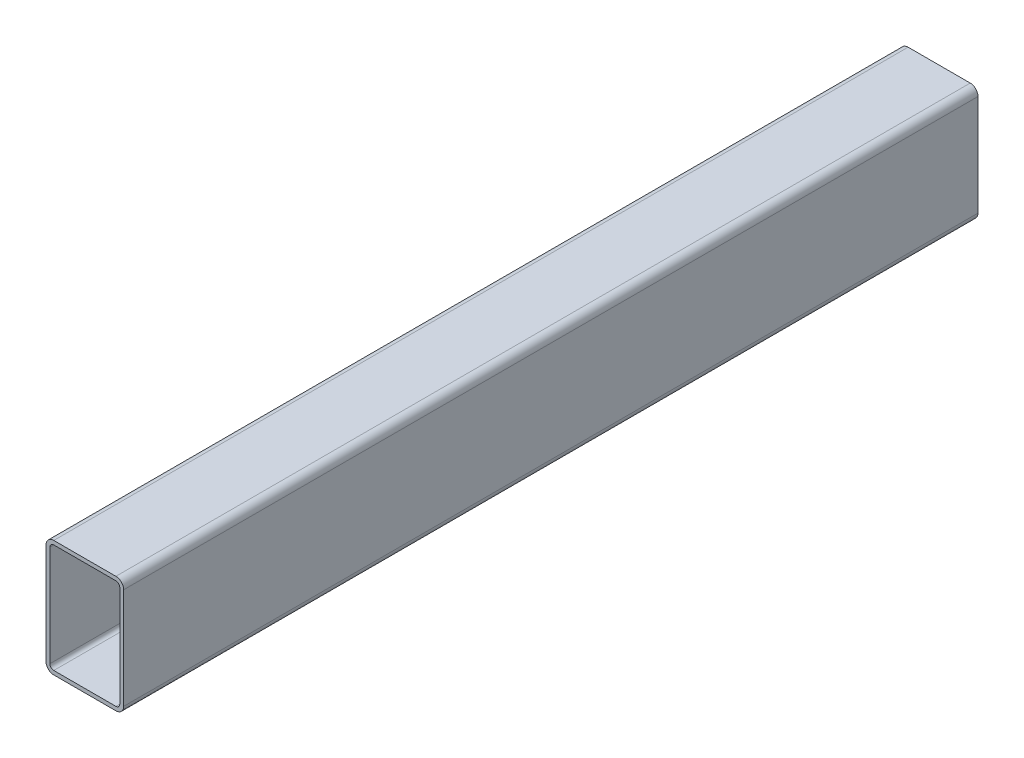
ISO-10303-21;
HEADER;
FILE_DESCRIPTION(('STEP AP214'),'2;1');
FILE_NAME('part.step','',(''),(''),'','','');
FILE_SCHEMA(('AUTOMOTIVE_DESIGN { 1 0 10303 214 1 1 1 1 }'));
ENDSEC;
DATA;
#1=APPLICATION_CONTEXT('core data for automotive mechanical design processes');
#2=APPLICATION_PROTOCOL_DEFINITION('international standard','automotive_design',2000,#1);
#3=PRODUCT_CONTEXT('',#1,'mechanical');
#4=PRODUCT('Part','Part','',(#3));
#5=PRODUCT_RELATED_PRODUCT_CATEGORY('part','',(#4));
#6=PRODUCT_DEFINITION_FORMATION('','',#4);
#7=PRODUCT_DEFINITION_CONTEXT('part definition',#1,'design');
#8=PRODUCT_DEFINITION('design','',#6,#7);
#9=PRODUCT_DEFINITION_SHAPE('','',#8);
#10=(LENGTH_UNIT() NAMED_UNIT(*) SI_UNIT(.MILLI.,.METRE.));
#11=(NAMED_UNIT(*) PLANE_ANGLE_UNIT() SI_UNIT($,.RADIAN.));
#12=(NAMED_UNIT(*) SI_UNIT($,.STERADIAN.) SOLID_ANGLE_UNIT());
#13=UNCERTAINTY_MEASURE_WITH_UNIT(LENGTH_MEASURE(1.E-05),#10,'distance_accuracy_value','');
#14=(GEOMETRIC_REPRESENTATION_CONTEXT(3) GLOBAL_UNCERTAINTY_ASSIGNED_CONTEXT((#13)) GLOBAL_UNIT_ASSIGNED_CONTEXT((#10,
#11,#12)) REPRESENTATION_CONTEXT('',''));
#15=CARTESIAN_POINT('',(0.,0.,0.));
#16=DIRECTION('',(0.,0.,1.));
#17=DIRECTION('',(1.,0.,0.));
#18=AXIS2_PLACEMENT_3D('',#15,#16,#17);
#19=CARTESIAN_POINT('',(-16.,26.0000000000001,220.));
#20=DIRECTION('',(0.,0.,1.));
#21=DIRECTION('',(1.,0.,0.));
#22=AXIS2_PLACEMENT_3D('',#19,#20,#21);
#23=PLANE('',#22);
#24=CARTESIAN_POINT('',(-16.,26.0000000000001,220.));
#25=DIRECTION('',(0.,0.,1.));
#26=DIRECTION('',(-1.,0.,0.));
#27=AXIS2_PLACEMENT_3D('',#24,#25,#26);
#28=CIRCLE('',#27,4.00000000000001);
#29=CARTESIAN_POINT('',(-16.,30.0000000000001,220.));
#30=VERTEX_POINT('',#29);
#31=CARTESIAN_POINT('',(-20.,26.0000000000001,220.));
#32=VERTEX_POINT('',#31);
#33=EDGE_CURVE('E221',#30,#32,#28,.T.);
#34=ORIENTED_EDGE('',*,*,#33,.T.);
#35=DIRECTION('',(0.,-1.,0.));
#36=VECTOR('',#35,1.);
#37=CARTESIAN_POINT('',(-20.,26.0000000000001,220.));
#38=LINE('',#37,#36);
#39=CARTESIAN_POINT('',(-20.,-25.9999999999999,220.));
#40=VERTEX_POINT('',#39);
#41=EDGE_CURVE('E224',#32,#40,#38,.T.);
#42=ORIENTED_EDGE('',*,*,#41,.T.);
#43=CARTESIAN_POINT('',(-16.,-25.9999999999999,220.));
#44=DIRECTION('',(0.,0.,1.));
#45=DIRECTION('',(1.,0.,0.));
#46=AXIS2_PLACEMENT_3D('',#43,#44,#45);
#47=CIRCLE('',#46,4.00000000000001);
#48=CARTESIAN_POINT('',(-16.,-29.9999999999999,220.));
#49=VERTEX_POINT('',#48);
#50=EDGE_CURVE('E226',#40,#49,#47,.T.);
#51=ORIENTED_EDGE('',*,*,#50,.T.);
#52=DIRECTION('',(1.,0.,0.));
#53=VECTOR('',#52,1.);
#54=CARTESIAN_POINT('',(16.,-29.9999999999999,220.));
#55=LINE('',#54,#53);
#56=CARTESIAN_POINT('',(16.,-29.9999999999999,220.));
#57=VERTEX_POINT('',#56);
#58=EDGE_CURVE('E228',#49,#57,#55,.T.);
#59=ORIENTED_EDGE('',*,*,#58,.T.);
#60=CARTESIAN_POINT('',(16.,-25.9999999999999,220.));
#61=DIRECTION('',(0.,0.,1.));
#62=DIRECTION('',(1.,0.,0.));
#63=AXIS2_PLACEMENT_3D('',#60,#61,#62);
#64=CIRCLE('',#63,4.00000000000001);
#65=CARTESIAN_POINT('',(20.,-25.9999999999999,220.));
#66=VERTEX_POINT('',#65);
#67=EDGE_CURVE('E230',#57,#66,#64,.T.);
#68=ORIENTED_EDGE('',*,*,#67,.T.);
#69=DIRECTION('',(0.,1.,0.));
#70=VECTOR('',#69,1.);
#71=CARTESIAN_POINT('',(20.,26.0000000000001,220.));
#72=LINE('',#71,#70);
#73=CARTESIAN_POINT('',(20.,26.0000000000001,220.));
#74=VERTEX_POINT('',#73);
#75=EDGE_CURVE('E232',#66,#74,#72,.T.);
#76=ORIENTED_EDGE('',*,*,#75,.T.);
#77=CARTESIAN_POINT('',(16.,26.0000000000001,220.));
#78=DIRECTION('',(0.,0.,1.));
#79=DIRECTION('',(1.,0.,0.));
#80=AXIS2_PLACEMENT_3D('',#77,#78,#79);
#81=CIRCLE('',#80,4.00000000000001);
#82=CARTESIAN_POINT('',(16.,30.0000000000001,220.));
#83=VERTEX_POINT('',#82);
#84=EDGE_CURVE('E234',#74,#83,#81,.T.);
#85=ORIENTED_EDGE('',*,*,#84,.T.);
#86=DIRECTION('',(-1.,0.,0.));
#87=VECTOR('',#86,1.);
#88=CARTESIAN_POINT('',(16.,30.0000000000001,220.));
#89=LINE('',#88,#87);
#90=EDGE_CURVE('E236',#83,#30,#89,.T.);
#91=ORIENTED_EDGE('',*,*,#90,.T.);
#92=EDGE_LOOP('',(#34,#42,#51,#59,#68,#76,#85,#91));
#93=FACE_BOUND('',#92,.T.);
#94=DIRECTION('',(0.,-1.,0.));
#95=VECTOR('',#94,1.);
#96=CARTESIAN_POINT('',(-18.,26.0000000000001,220.));
#97=LINE('',#96,#95);
#98=CARTESIAN_POINT('',(-18.,26.0000000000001,220.));
#99=VERTEX_POINT('',#98);
#100=CARTESIAN_POINT('',(-18.,-25.9999999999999,220.));
#101=VERTEX_POINT('',#100);
#102=EDGE_CURVE('E179',#99,#101,#97,.T.);
#103=ORIENTED_EDGE('',*,*,#102,.F.);
#104=CARTESIAN_POINT('',(-16.,26.0000000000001,220.));
#105=DIRECTION('',(0.,0.,-1.));
#106=DIRECTION('',(-1.,0.,0.));
#107=AXIS2_PLACEMENT_3D('',#104,#105,#106);
#108=CIRCLE('',#107,2.00000000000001);
#109=CARTESIAN_POINT('',(-16.,28.0000000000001,220.));
#110=VERTEX_POINT('',#109);
#111=EDGE_CURVE('E156',#110,#99,#108,.F.);
#112=ORIENTED_EDGE('',*,*,#111,.F.);
#113=DIRECTION('',(-1.,0.,0.));
#114=VECTOR('',#113,1.);
#115=CARTESIAN_POINT('',(-16.,28.0000000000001,220.));
#116=LINE('',#115,#114);
#117=CARTESIAN_POINT('',(16.,28.0000000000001,220.));
#118=VERTEX_POINT('',#117);
#119=EDGE_CURVE('E191',#118,#110,#116,.T.);
#120=ORIENTED_EDGE('',*,*,#119,.F.);
#121=CARTESIAN_POINT('',(16.,26.0000000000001,220.));
#122=DIRECTION('',(0.,0.,-1.));
#123=DIRECTION('',(-1.,0.,0.));
#124=AXIS2_PLACEMENT_3D('',#121,#122,#123);
#125=CIRCLE('',#124,2.00000000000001);
#126=CARTESIAN_POINT('',(18.,26.0000000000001,220.));
#127=VERTEX_POINT('',#126);
#128=EDGE_CURVE('E189',#127,#118,#125,.F.);
#129=ORIENTED_EDGE('',*,*,#128,.F.);
#130=DIRECTION('',(0.,1.,0.));
#131=VECTOR('',#130,1.);
#132=CARTESIAN_POINT('',(18.,26.0000000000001,220.));
#133=LINE('',#132,#131);
#134=CARTESIAN_POINT('',(18.,-25.9999999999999,220.));
#135=VERTEX_POINT('',#134);
#136=EDGE_CURVE('E187',#135,#127,#133,.T.);
#137=ORIENTED_EDGE('',*,*,#136,.F.);
#138=CARTESIAN_POINT('',(16.,-25.9999999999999,220.));
#139=DIRECTION('',(0.,0.,-1.));
#140=DIRECTION('',(-1.,0.,0.));
#141=AXIS2_PLACEMENT_3D('',#138,#139,#140);
#142=CIRCLE('',#141,2.00000000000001);
#143=CARTESIAN_POINT('',(16.,-27.9999999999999,220.));
#144=VERTEX_POINT('',#143);
#145=EDGE_CURVE('E185',#144,#135,#142,.F.);
#146=ORIENTED_EDGE('',*,*,#145,.F.);
#147=DIRECTION('',(1.,0.,0.));
#148=VECTOR('',#147,1.);
#149=CARTESIAN_POINT('',(-16.,-27.9999999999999,220.));
#150=LINE('',#149,#148);
#151=CARTESIAN_POINT('',(-16.,-27.9999999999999,220.));
#152=VERTEX_POINT('',#151);
#153=EDGE_CURVE('E183',#152,#144,#150,.T.);
#154=ORIENTED_EDGE('',*,*,#153,.F.);
#155=CARTESIAN_POINT('',(-16.,-25.9999999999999,220.));
#156=DIRECTION('',(0.,0.,-1.));
#157=DIRECTION('',(-1.,0.,0.));
#158=AXIS2_PLACEMENT_3D('',#155,#156,#157);
#159=CIRCLE('',#158,2.00000000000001);
#160=EDGE_CURVE('E181',#101,#152,#159,.F.);
#161=ORIENTED_EDGE('',*,*,#160,.F.);
#162=EDGE_LOOP('',(#103,#112,#120,#129,#137,#146,#154,#161));
#163=FACE_BOUND('',#162,.T.);
#164=ADVANCED_FACE('F28',(#93,#163),#23,.T.);
#165=CARTESIAN_POINT('',(-16.,25.9999999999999,-220.));
#166=DIRECTION('',(0.,0.,1.));
#167=DIRECTION('',(1.,0.,0.));
#168=AXIS2_PLACEMENT_3D('',#165,#166,#167);
#169=PLANE('',#168);
#170=CARTESIAN_POINT('',(-16.,25.9999999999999,-220.));
#171=DIRECTION('',(0.,0.,1.));
#172=DIRECTION('',(-1.,0.,0.));
#173=AXIS2_PLACEMENT_3D('',#170,#171,#172);
#174=CIRCLE('',#173,4.00000000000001);
#175=CARTESIAN_POINT('',(-16.,29.9999999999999,-220.));
#176=VERTEX_POINT('',#175);
#177=CARTESIAN_POINT('',(-20.,25.9999999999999,-220.));
#178=VERTEX_POINT('',#177);
#179=EDGE_CURVE('E157',#176,#178,#174,.T.);
#180=ORIENTED_EDGE('',*,*,#179,.F.);
#181=DIRECTION('',(-1.,0.,0.));
#182=VECTOR('',#181,1.);
#183=CARTESIAN_POINT('',(16.,29.9999999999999,-220.));
#184=LINE('',#183,#182);
#185=CARTESIAN_POINT('',(16.,29.9999999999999,-220.));
#186=VERTEX_POINT('',#185);
#187=EDGE_CURVE('E219',#186,#176,#184,.T.);
#188=ORIENTED_EDGE('',*,*,#187,.F.);
#189=CARTESIAN_POINT('',(16.,25.9999999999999,-220.));
#190=DIRECTION('',(0.,0.,1.));
#191=DIRECTION('',(1.,0.,0.));
#192=AXIS2_PLACEMENT_3D('',#189,#190,#191);
#193=CIRCLE('',#192,4.00000000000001);
#194=CARTESIAN_POINT('',(20.,25.9999999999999,-220.));
#195=VERTEX_POINT('',#194);
#196=EDGE_CURVE('E217',#195,#186,#193,.T.);
#197=ORIENTED_EDGE('',*,*,#196,.F.);
#198=DIRECTION('',(0.,1.,0.));
#199=VECTOR('',#198,1.);
#200=CARTESIAN_POINT('',(20.,25.9999999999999,-220.));
#201=LINE('',#200,#199);
#202=CARTESIAN_POINT('',(20.,-26.0000000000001,-220.));
#203=VERTEX_POINT('',#202);
#204=EDGE_CURVE('E215',#203,#195,#201,.T.);
#205=ORIENTED_EDGE('',*,*,#204,.F.);
#206=CARTESIAN_POINT('',(16.,-26.0000000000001,-220.));
#207=DIRECTION('',(0.,0.,1.));
#208=DIRECTION('',(1.,0.,0.));
#209=AXIS2_PLACEMENT_3D('',#206,#207,#208);
#210=CIRCLE('',#209,4.00000000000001);
#211=CARTESIAN_POINT('',(16.,-30.0000000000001,-220.));
#212=VERTEX_POINT('',#211);
#213=EDGE_CURVE('E213',#212,#203,#210,.T.);
#214=ORIENTED_EDGE('',*,*,#213,.F.);
#215=DIRECTION('',(1.,0.,0.));
#216=VECTOR('',#215,1.);
#217=CARTESIAN_POINT('',(16.,-30.0000000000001,-220.));
#218=LINE('',#217,#216);
#219=CARTESIAN_POINT('',(-16.,-30.0000000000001,-220.));
#220=VERTEX_POINT('',#219);
#221=EDGE_CURVE('E211',#220,#212,#218,.T.);
#222=ORIENTED_EDGE('',*,*,#221,.F.);
#223=CARTESIAN_POINT('',(-16.,-26.0000000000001,-220.));
#224=DIRECTION('',(0.,0.,1.));
#225=DIRECTION('',(1.,0.,0.));
#226=AXIS2_PLACEMENT_3D('',#223,#224,#225);
#227=CIRCLE('',#226,4.00000000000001);
#228=CARTESIAN_POINT('',(-20.,-26.0000000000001,-220.));
#229=VERTEX_POINT('',#228);
#230=EDGE_CURVE('E209',#229,#220,#227,.T.);
#231=ORIENTED_EDGE('',*,*,#230,.F.);
#232=DIRECTION('',(0.,-1.,0.));
#233=VECTOR('',#232,1.);
#234=CARTESIAN_POINT('',(-20.,25.9999999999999,-220.));
#235=LINE('',#234,#233);
#236=EDGE_CURVE('E207',#178,#229,#235,.T.);
#237=ORIENTED_EDGE('',*,*,#236,.F.);
#238=EDGE_LOOP('',(#180,#188,#197,#205,#214,#222,#231,#237));
#239=FACE_BOUND('',#238,.T.);
#240=CARTESIAN_POINT('',(-16.,25.9999999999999,-220.));
#241=DIRECTION('',(0.,0.,-1.));
#242=DIRECTION('',(-1.,0.,0.));
#243=AXIS2_PLACEMENT_3D('',#240,#241,#242);
#244=CIRCLE('',#243,2.00000000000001);
#245=CARTESIAN_POINT('',(-16.,27.9999999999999,-220.));
#246=VERTEX_POINT('',#245);
#247=CARTESIAN_POINT('',(-18.,25.9999999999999,-220.));
#248=VERTEX_POINT('',#247);
#249=EDGE_CURVE('E51',#246,#248,#244,.F.);
#250=ORIENTED_EDGE('',*,*,#249,.T.);
#251=DIRECTION('',(0.,-1.,0.));
#252=VECTOR('',#251,1.);
#253=CARTESIAN_POINT('',(-18.,25.9999999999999,-220.));
#254=LINE('',#253,#252);
#255=CARTESIAN_POINT('',(-18.,-26.0000000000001,-220.));
#256=VERTEX_POINT('',#255);
#257=EDGE_CURVE('E143',#248,#256,#254,.T.);
#258=ORIENTED_EDGE('',*,*,#257,.T.);
#259=CARTESIAN_POINT('',(-16.,-26.0000000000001,-220.));
#260=DIRECTION('',(0.,0.,-1.));
#261=DIRECTION('',(-1.,0.,0.));
#262=AXIS2_PLACEMENT_3D('',#259,#260,#261);
#263=CIRCLE('',#262,2.00000000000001);
#264=CARTESIAN_POINT('',(-16.,-28.0000000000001,-220.));
#265=VERTEX_POINT('',#264);
#266=EDGE_CURVE('E152',#256,#265,#263,.F.);
#267=ORIENTED_EDGE('',*,*,#266,.T.);
#268=DIRECTION('',(1.,0.,0.));
#269=VECTOR('',#268,1.);
#270=CARTESIAN_POINT('',(-16.,-28.0000000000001,-220.));
#271=LINE('',#270,#269);
#272=CARTESIAN_POINT('',(16.,-28.0000000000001,-220.));
#273=VERTEX_POINT('',#272);
#274=EDGE_CURVE('E166',#265,#273,#271,.T.);
#275=ORIENTED_EDGE('',*,*,#274,.T.);
#276=CARTESIAN_POINT('',(16.,-26.0000000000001,-220.));
#277=DIRECTION('',(0.,0.,-1.));
#278=DIRECTION('',(-1.,0.,0.));
#279=AXIS2_PLACEMENT_3D('',#276,#277,#278);
#280=CIRCLE('',#279,2.00000000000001);
#281=CARTESIAN_POINT('',(18.,-26.0000000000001,-220.));
#282=VERTEX_POINT('',#281);
#283=EDGE_CURVE('E169',#273,#282,#280,.F.);
#284=ORIENTED_EDGE('',*,*,#283,.T.);
#285=DIRECTION('',(0.,1.,0.));
#286=VECTOR('',#285,1.);
#287=CARTESIAN_POINT('',(18.,25.9999999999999,-220.));
#288=LINE('',#287,#286);
#289=CARTESIAN_POINT('',(18.,25.9999999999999,-220.));
#290=VERTEX_POINT('',#289);
#291=EDGE_CURVE('E172',#282,#290,#288,.T.);
#292=ORIENTED_EDGE('',*,*,#291,.T.);
#293=CARTESIAN_POINT('',(16.,25.9999999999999,-220.));
#294=DIRECTION('',(0.,0.,-1.));
#295=DIRECTION('',(-1.,0.,0.));
#296=AXIS2_PLACEMENT_3D('',#293,#294,#295);
#297=CIRCLE('',#296,2.00000000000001);
#298=CARTESIAN_POINT('',(16.,27.9999999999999,-220.));
#299=VERTEX_POINT('',#298);
#300=EDGE_CURVE('E175',#290,#299,#297,.F.);
#301=ORIENTED_EDGE('',*,*,#300,.T.);
#302=DIRECTION('',(-1.,0.,0.));
#303=VECTOR('',#302,1.);
#304=CARTESIAN_POINT('',(-16.,27.9999999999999,-220.));
#305=LINE('',#304,#303);
#306=EDGE_CURVE('E162',#299,#246,#305,.T.);
#307=ORIENTED_EDGE('',*,*,#306,.T.);
#308=EDGE_LOOP('',(#250,#258,#267,#275,#284,#292,#301,#307));
#309=FACE_BOUND('',#308,.T.);
#310=ADVANCED_FACE('F160',(#239,#309),#169,.F.);
#311=CARTESIAN_POINT('',(-16.,26.0000000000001,220.));
#312=DIRECTION('',(0.,0.,-1.));
#313=DIRECTION('',(-1.,0.,0.));
#314=AXIS2_PLACEMENT_3D('',#311,#312,#313);
#315=CYLINDRICAL_SURFACE('',#314,4.00000000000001);
#316=ORIENTED_EDGE('',*,*,#179,.T.);
#317=DIRECTION('',(0.,0.,-1.));
#318=VECTOR('',#317,1.);
#319=CARTESIAN_POINT('',(-20.,26.0000000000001,220.));
#320=LINE('',#319,#318);
#321=EDGE_CURVE('E11',#32,#178,#320,.T.);
#322=ORIENTED_EDGE('',*,*,#321,.F.);
#323=ORIENTED_EDGE('',*,*,#33,.F.);
#324=DIRECTION('',(0.,0.,-1.));
#325=VECTOR('',#324,1.);
#326=CARTESIAN_POINT('',(-16.,30.0000000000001,220.));
#327=LINE('',#326,#325);
#328=EDGE_CURVE('E238',#30,#176,#327,.T.);
#329=ORIENTED_EDGE('',*,*,#328,.T.);
#330=EDGE_LOOP('',(#316,#322,#323,#329));
#331=FACE_BOUND('',#330,.T.);
#332=ADVANCED_FACE('F30',(#331),#315,.T.);
#333=CARTESIAN_POINT('',(-20.,26.0000000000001,220.));
#334=DIRECTION('',(1.,0.,0.));
#335=DIRECTION('',(0.,0.,-1.));
#336=AXIS2_PLACEMENT_3D('',#333,#334,#335);
#337=PLANE('',#336);
#338=ORIENTED_EDGE('',*,*,#236,.T.);
#339=DIRECTION('',(0.,0.,-1.));
#340=VECTOR('',#339,1.);
#341=CARTESIAN_POINT('',(-20.,-25.9999999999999,220.));
#342=LINE('',#341,#340);
#343=EDGE_CURVE('E36',#40,#229,#342,.T.);
#344=ORIENTED_EDGE('',*,*,#343,.F.);
#345=ORIENTED_EDGE('',*,*,#41,.F.);
#346=ORIENTED_EDGE('',*,*,#321,.T.);
#347=EDGE_LOOP('',(#338,#344,#345,#346));
#348=FACE_BOUND('',#347,.T.);
#349=ADVANCED_FACE('F282',(#348),#337,.F.);
#350=CARTESIAN_POINT('',(-16.,-25.9999999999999,220.));
#351=DIRECTION('',(0.,0.,-1.));
#352=DIRECTION('',(-1.,0.,0.));
#353=AXIS2_PLACEMENT_3D('',#350,#351,#352);
#354=CYLINDRICAL_SURFACE('',#353,4.00000000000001);
#355=ORIENTED_EDGE('',*,*,#230,.T.);
#356=DIRECTION('',(0.,0.,-1.));
#357=VECTOR('',#356,1.);
#358=CARTESIAN_POINT('',(-16.,-29.9999999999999,220.));
#359=LINE('',#358,#357);
#360=EDGE_CURVE('E253',#49,#220,#359,.T.);
#361=ORIENTED_EDGE('',*,*,#360,.F.);
#362=ORIENTED_EDGE('',*,*,#50,.F.);
#363=ORIENTED_EDGE('',*,*,#343,.T.);
#364=EDGE_LOOP('',(#355,#361,#362,#363));
#365=FACE_BOUND('',#364,.T.);
#366=ADVANCED_FACE('F260',(#365),#354,.T.);
#367=CARTESIAN_POINT('',(16.,-29.9999999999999,220.));
#368=DIRECTION('',(0.,1.,0.));
#369=DIRECTION('',(-1.,0.,0.));
#370=AXIS2_PLACEMENT_3D('',#367,#368,#369);
#371=PLANE('',#370);
#372=ORIENTED_EDGE('',*,*,#221,.T.);
#373=DIRECTION('',(0.,0.,-1.));
#374=VECTOR('',#373,1.);
#375=CARTESIAN_POINT('',(16.,-29.9999999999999,220.));
#376=LINE('',#375,#374);
#377=EDGE_CURVE('E250',#57,#212,#376,.T.);
#378=ORIENTED_EDGE('',*,*,#377,.F.);
#379=ORIENTED_EDGE('',*,*,#58,.F.);
#380=ORIENTED_EDGE('',*,*,#360,.T.);
#381=EDGE_LOOP('',(#372,#378,#379,#380));
#382=FACE_BOUND('',#381,.T.);
#383=ADVANCED_FACE('F270',(#382),#371,.F.);
#384=CARTESIAN_POINT('',(16.,-25.9999999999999,220.));
#385=DIRECTION('',(0.,0.,-1.));
#386=DIRECTION('',(-1.,0.,0.));
#387=AXIS2_PLACEMENT_3D('',#384,#385,#386);
#388=CYLINDRICAL_SURFACE('',#387,4.00000000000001);
#389=ORIENTED_EDGE('',*,*,#213,.T.);
#390=DIRECTION('',(0.,0.,-1.));
#391=VECTOR('',#390,1.);
#392=CARTESIAN_POINT('',(20.,-25.9999999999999,220.));
#393=LINE('',#392,#391);
#394=EDGE_CURVE('E247',#66,#203,#393,.T.);
#395=ORIENTED_EDGE('',*,*,#394,.F.);
#396=ORIENTED_EDGE('',*,*,#67,.F.);
#397=ORIENTED_EDGE('',*,*,#377,.T.);
#398=EDGE_LOOP('',(#389,#395,#396,#397));
#399=FACE_BOUND('',#398,.T.);
#400=ADVANCED_FACE('F274',(#399),#388,.T.);
#401=CARTESIAN_POINT('',(20.,26.0000000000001,220.));
#402=DIRECTION('',(-1.,0.,0.));
#403=DIRECTION('',(0.,0.,1.));
#404=AXIS2_PLACEMENT_3D('',#401,#402,#403);
#405=PLANE('',#404);
#406=ORIENTED_EDGE('',*,*,#204,.T.);
#407=DIRECTION('',(0.,0.,-1.));
#408=VECTOR('',#407,1.);
#409=CARTESIAN_POINT('',(20.,26.0000000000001,220.));
#410=LINE('',#409,#408);
#411=EDGE_CURVE('E244',#74,#195,#410,.T.);
#412=ORIENTED_EDGE('',*,*,#411,.F.);
#413=ORIENTED_EDGE('',*,*,#75,.F.);
#414=ORIENTED_EDGE('',*,*,#394,.T.);
#415=EDGE_LOOP('',(#406,#412,#413,#414));
#416=FACE_BOUND('',#415,.T.);
#417=ADVANCED_FACE('F295',(#416),#405,.F.);
#418=CARTESIAN_POINT('',(16.,26.0000000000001,220.));
#419=DIRECTION('',(0.,0.,-1.));
#420=DIRECTION('',(-1.,0.,0.));
#421=AXIS2_PLACEMENT_3D('',#418,#419,#420);
#422=CYLINDRICAL_SURFACE('',#421,4.00000000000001);
#423=ORIENTED_EDGE('',*,*,#196,.T.);
#424=DIRECTION('',(0.,0.,-1.));
#425=VECTOR('',#424,1.);
#426=CARTESIAN_POINT('',(16.,30.0000000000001,220.));
#427=LINE('',#426,#425);
#428=EDGE_CURVE('E241',#83,#186,#427,.T.);
#429=ORIENTED_EDGE('',*,*,#428,.F.);
#430=ORIENTED_EDGE('',*,*,#84,.F.);
#431=ORIENTED_EDGE('',*,*,#411,.T.);
#432=EDGE_LOOP('',(#423,#429,#430,#431));
#433=FACE_BOUND('',#432,.T.);
#434=ADVANCED_FACE('F293',(#433),#422,.T.);
#435=CARTESIAN_POINT('',(16.,30.0000000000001,220.));
#436=DIRECTION('',(0.,-1.,0.));
#437=DIRECTION('',(1.,0.,0.));
#438=AXIS2_PLACEMENT_3D('',#435,#436,#437);
#439=PLANE('',#438);
#440=ORIENTED_EDGE('',*,*,#187,.T.);
#441=ORIENTED_EDGE('',*,*,#328,.F.);
#442=ORIENTED_EDGE('',*,*,#90,.F.);
#443=ORIENTED_EDGE('',*,*,#428,.T.);
#444=EDGE_LOOP('',(#440,#441,#442,#443));
#445=FACE_BOUND('',#444,.T.);
#446=ADVANCED_FACE('F288',(#445),#439,.F.);
#447=CARTESIAN_POINT('',(-16.,26.0000000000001,220.));
#448=DIRECTION('',(0.,0.,-1.));
#449=DIRECTION('',(-1.,0.,0.));
#450=AXIS2_PLACEMENT_3D('',#447,#448,#449);
#451=CYLINDRICAL_SURFACE('',#450,2.00000000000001);
#452=ORIENTED_EDGE('',*,*,#249,.F.);
#453=DIRECTION('',(0.,0.,-1.));
#454=VECTOR('',#453,1.);
#455=CARTESIAN_POINT('',(-16.,28.0000000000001,220.));
#456=LINE('',#455,#454);
#457=EDGE_CURVE('E193',#110,#246,#456,.T.);
#458=ORIENTED_EDGE('',*,*,#457,.F.);
#459=ORIENTED_EDGE('',*,*,#111,.T.);
#460=DIRECTION('',(0.,0.,-1.));
#461=VECTOR('',#460,1.);
#462=CARTESIAN_POINT('',(-18.,26.0000000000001,220.));
#463=LINE('',#462,#461);
#464=EDGE_CURVE('E145',#99,#248,#463,.T.);
#465=ORIENTED_EDGE('',*,*,#464,.T.);
#466=EDGE_LOOP('',(#452,#458,#459,#465));
#467=FACE_BOUND('',#466,.T.);
#468=ADVANCED_FACE('F154',(#467),#451,.F.);
#469=CARTESIAN_POINT('',(-18.,26.0000000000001,220.));
#470=DIRECTION('',(1.,0.,0.));
#471=DIRECTION('',(0.,0.,-1.));
#472=AXIS2_PLACEMENT_3D('',#469,#470,#471);
#473=PLANE('',#472);
#474=ORIENTED_EDGE('',*,*,#257,.F.);
#475=ORIENTED_EDGE('',*,*,#464,.F.);
#476=ORIENTED_EDGE('',*,*,#102,.T.);
#477=DIRECTION('',(0.,0.,-1.));
#478=VECTOR('',#477,1.);
#479=CARTESIAN_POINT('',(-18.,-25.9999999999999,220.));
#480=LINE('',#479,#478);
#481=EDGE_CURVE('E148',#101,#256,#480,.T.);
#482=ORIENTED_EDGE('',*,*,#481,.T.);
#483=EDGE_LOOP('',(#474,#475,#476,#482));
#484=FACE_BOUND('',#483,.T.);
#485=ADVANCED_FACE('F144',(#484),#473,.T.);
#486=CARTESIAN_POINT('',(-16.,-25.9999999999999,220.));
#487=DIRECTION('',(0.,0.,-1.));
#488=DIRECTION('',(-1.,0.,0.));
#489=AXIS2_PLACEMENT_3D('',#486,#487,#488);
#490=CYLINDRICAL_SURFACE('',#489,2.00000000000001);
#491=ORIENTED_EDGE('',*,*,#266,.F.);
#492=ORIENTED_EDGE('',*,*,#481,.F.);
#493=ORIENTED_EDGE('',*,*,#160,.T.);
#494=DIRECTION('',(0.,0.,-1.));
#495=VECTOR('',#494,1.);
#496=CARTESIAN_POINT('',(-16.,-27.9999999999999,220.));
#497=LINE('',#496,#495);
#498=EDGE_CURVE('E202',#152,#265,#497,.T.);
#499=ORIENTED_EDGE('',*,*,#498,.T.);
#500=EDGE_LOOP('',(#491,#492,#493,#499));
#501=FACE_BOUND('',#500,.T.);
#502=ADVANCED_FACE('F319',(#501),#490,.F.);
#503=CARTESIAN_POINT('',(-16.,-27.9999999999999,220.));
#504=DIRECTION('',(0.,1.,0.));
#505=DIRECTION('',(-1.,0.,0.));
#506=AXIS2_PLACEMENT_3D('',#503,#504,#505);
#507=PLANE('',#506);
#508=ORIENTED_EDGE('',*,*,#274,.F.);
#509=ORIENTED_EDGE('',*,*,#498,.F.);
#510=ORIENTED_EDGE('',*,*,#153,.T.);
#511=DIRECTION('',(0.,0.,-1.));
#512=VECTOR('',#511,1.);
#513=CARTESIAN_POINT('',(16.,-27.9999999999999,220.));
#514=LINE('',#513,#512);
#515=EDGE_CURVE('E200',#144,#273,#514,.T.);
#516=ORIENTED_EDGE('',*,*,#515,.T.);
#517=EDGE_LOOP('',(#508,#509,#510,#516));
#518=FACE_BOUND('',#517,.T.);
#519=ADVANCED_FACE('F324',(#518),#507,.T.);
#520=CARTESIAN_POINT('',(16.,-25.9999999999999,220.));
#521=DIRECTION('',(0.,0.,-1.));
#522=DIRECTION('',(-1.,0.,0.));
#523=AXIS2_PLACEMENT_3D('',#520,#521,#522);
#524=CYLINDRICAL_SURFACE('',#523,2.00000000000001);
#525=ORIENTED_EDGE('',*,*,#283,.F.);
#526=ORIENTED_EDGE('',*,*,#515,.F.);
#527=ORIENTED_EDGE('',*,*,#145,.T.);
#528=DIRECTION('',(0.,0.,-1.));
#529=VECTOR('',#528,1.);
#530=CARTESIAN_POINT('',(18.,-25.9999999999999,220.));
#531=LINE('',#530,#529);
#532=EDGE_CURVE('E198',#135,#282,#531,.T.);
#533=ORIENTED_EDGE('',*,*,#532,.T.);
#534=EDGE_LOOP('',(#525,#526,#527,#533));
#535=FACE_BOUND('',#534,.T.);
#536=ADVANCED_FACE('F328',(#535),#524,.F.);
#537=CARTESIAN_POINT('',(18.,26.0000000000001,220.));
#538=DIRECTION('',(-1.,0.,0.));
#539=DIRECTION('',(0.,0.,1.));
#540=AXIS2_PLACEMENT_3D('',#537,#538,#539);
#541=PLANE('',#540);
#542=ORIENTED_EDGE('',*,*,#291,.F.);
#543=ORIENTED_EDGE('',*,*,#532,.F.);
#544=ORIENTED_EDGE('',*,*,#136,.T.);
#545=DIRECTION('',(0.,0.,-1.));
#546=VECTOR('',#545,1.);
#547=CARTESIAN_POINT('',(18.,26.0000000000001,220.));
#548=LINE('',#547,#546);
#549=EDGE_CURVE('E196',#127,#290,#548,.T.);
#550=ORIENTED_EDGE('',*,*,#549,.T.);
#551=EDGE_LOOP('',(#542,#543,#544,#550));
#552=FACE_BOUND('',#551,.T.);
#553=ADVANCED_FACE('F332',(#552),#541,.T.);
#554=CARTESIAN_POINT('',(16.,26.0000000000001,220.));
#555=DIRECTION('',(0.,0.,-1.));
#556=DIRECTION('',(-1.,0.,0.));
#557=AXIS2_PLACEMENT_3D('',#554,#555,#556);
#558=CYLINDRICAL_SURFACE('',#557,2.00000000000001);
#559=ORIENTED_EDGE('',*,*,#300,.F.);
#560=ORIENTED_EDGE('',*,*,#549,.F.);
#561=ORIENTED_EDGE('',*,*,#128,.T.);
#562=DIRECTION('',(0.,0.,-1.));
#563=VECTOR('',#562,1.);
#564=CARTESIAN_POINT('',(16.,28.0000000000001,220.));
#565=LINE('',#564,#563);
#566=EDGE_CURVE('E43',#118,#299,#565,.T.);
#567=ORIENTED_EDGE('',*,*,#566,.T.);
#568=EDGE_LOOP('',(#559,#560,#561,#567));
#569=FACE_BOUND('',#568,.T.);
#570=ADVANCED_FACE('F336',(#569),#558,.F.);
#571=CARTESIAN_POINT('',(-16.,28.0000000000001,220.));
#572=DIRECTION('',(0.,-1.,0.));
#573=DIRECTION('',(1.,0.,0.));
#574=AXIS2_PLACEMENT_3D('',#571,#572,#573);
#575=PLANE('',#574);
#576=ORIENTED_EDGE('',*,*,#306,.F.);
#577=ORIENTED_EDGE('',*,*,#566,.F.);
#578=ORIENTED_EDGE('',*,*,#119,.T.);
#579=ORIENTED_EDGE('',*,*,#457,.T.);
#580=EDGE_LOOP('',(#576,#577,#578,#579));
#581=FACE_BOUND('',#580,.T.);
#582=ADVANCED_FACE('F340',(#581),#575,.T.);
#583=CLOSED_SHELL('',(#164,#310,#332,#349,#366,#383,#400,#417,#434,#446,#468,#485,#502,#519,
#536,#553,#570,#582));
#584=MANIFOLD_SOLID_BREP('B2',#583);
#585=ADVANCED_BREP_SHAPE_REPRESENTATION('',(#18,#584),#14);
#586=SHAPE_DEFINITION_REPRESENTATION(#9,#585);
ENDSEC;
END-ISO-10303-21;
